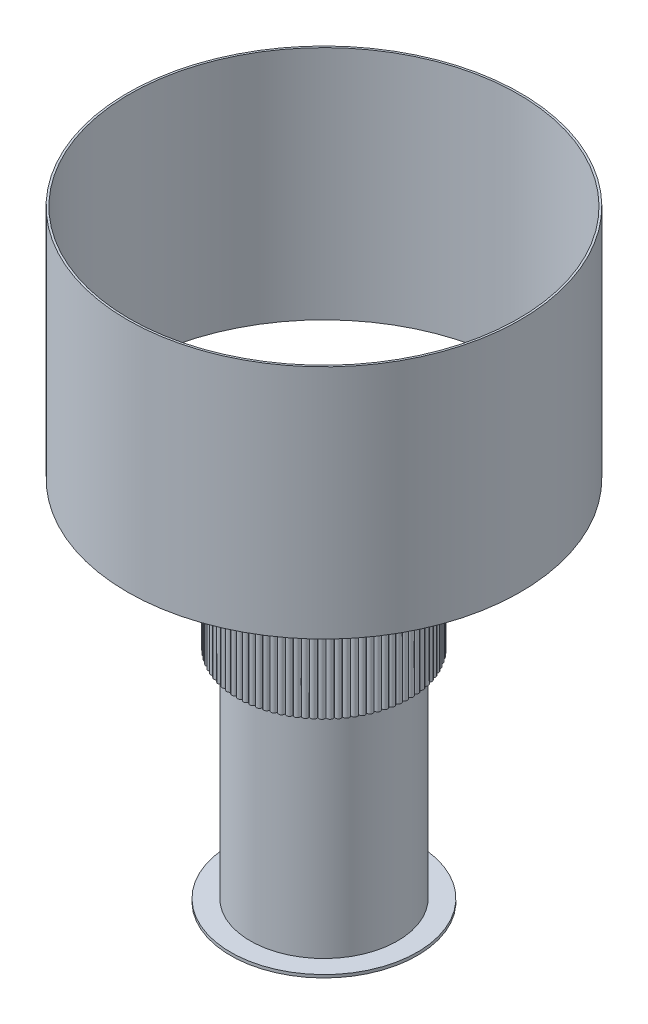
from build123d import *

# Parameters (mm, degrees)
SALIENTE_EXTRUIR1_DEPTH   = 100
CROQUIS2_R                = 77.5
CORTAR_EXTRUIR1_DEPTH     = 90
CROQUIS3_R                = 5
CORTAR_EXTRUIR2_DEPTH     = 75
CROQUIS4_R                = 75
CROQUIS4_R_2              = 71
SALIENTE_EXTRUIR2_DEPTH   = 310
CROQUIS5_R                = 6
SALIENTE_EXTRUIR3_DEPTH   = 50
CROQUIS6_R                = 200
CROQUIS6_R_2              = 198
SALIENTE_EXTRUIR4_DEPTH   = 240
CROQUIS7_R                = 95
SALIENTE_EXTRUIR5_DEPTH   = 3
CROQUIS8_R                = 5
SALIENTE_EXTRUIR6_DEPTH   = 5
SALIENTE_EXTRUIR6_2_DEPTH = 5
SALIENTE_EXTRUIR6_3_DEPTH = 5
REDONDEO1_R               = 1
REDONDEO2_R               = 1
REDONDEO3_R               = 1
CROQUIS9_R                = 15
SALIENTE_EXTRUIR7_DEPTH   = 2


with BuildPart() as part:
    # Croquis1 → Saliente-Extruir1 (new body)
    with BuildSketch(Plane(origin=(0, 0, 0), x_dir=(1, 0, 0), z_dir=(0, 1, 0))):
        with BuildLine():
            ThreePointArc((2.980262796, 85.34356028), (0, 88), (-2.980262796, 85.34356028))
            ThreePointArc((-2.980262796, 85.34356028), (-6.138569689, 87.785636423), (-8.926268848, 84.927775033))
            ThreePointArc((-8.926268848, 84.927775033), (-12.247232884, 87.143590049), (-14.828787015, 84.098230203))
            ThreePointArc((-14.828787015, 84.098230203), (-18.296228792, 86.076988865), (-20.659060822, 82.858967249))
            ThreePointArc((-20.659060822, 82.858967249), (-24.256087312, 84.591029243), (-26.388685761, 81.216023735))
            ThreePointArc((-26.388685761, 81.216023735), (-30.097772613, 82.692950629), (-31.989747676, 79.177403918))
            ThreePointArc((-31.989747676, 79.177403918), (-35.792824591, 80.392000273), (-37.434958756, 76.753039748))
            ThreePointArc((-37.434958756, 76.753039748), (-41.313497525, 77.699388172), (-42.69779048, 73.954742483))
            ThreePointArc((-42.69779048, 73.954742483), (-46.632895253, 74.628232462), (-47.752602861, 70.796145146))
            ThreePointArc((-47.752602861, 70.796145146), (-51.725102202, 71.193495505), (-52.57476936, 67.292636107))
            ThreePointArc((-52.57476936, 67.292636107), (-56.565309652, 67.411910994), (-57.140796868, 63.461284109))
            ThreePointArc((-57.140796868, 63.461284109), (-61.1299366, 63.30190243), (-61.428440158, 59.320755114))
            ThreePointArc((-61.428440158, 59.320755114), (-65.396744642, 58.88349336), (-65.416810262, 54.891221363))
            ThreePointArc((-65.416810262, 54.891221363), (-69.344946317, 54.178209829), (-69.086476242, 50.1942631))
            ThreePointArc((-69.086476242, 50.1942631), (-72.955306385, 49.208975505), (-72.419559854, 45.252763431))
            ThreePointArc((-72.419559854, 45.252763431), (-76.210235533, 44), (-75.39982265, 40.090796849))
            ThreePointArc((-75.39982265, 40.090796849), (-79.093876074, 38.576660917), (-78.012745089, 34.733511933))
            ThreePointArc((-78.012745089, 34.733511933), (-81.592179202, 32.965380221), (-80.245597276, 29.207008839))
            ThreePointArc((-80.245597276, 29.207008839), (-83.692973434, 27.193495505), (-82.08750098, 23.538212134))
            ThreePointArc((-82.08750098, 23.538212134), (-85.386023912, 21.289126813), (-83.52948263, 17.754739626))
            ThreePointArc((-83.52948263, 17.754739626), (-86.663082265, 15.281039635), (-84.564517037, 11.884767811))
            ThreePointArc((-84.564517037, 11.884767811), (-87.517926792, 9.198504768), (-85.187561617, 5.956894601))
            ThreePointArc((-85.187561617, 5.956894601), (-87.946392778, 3.07115571), (-85.395580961, 0))
            ThreePointArc((-85.395580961, 0), (-87.946392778, -3.07115571), (-85.187561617, -5.956894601))
            ThreePointArc((-85.187561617, -5.956894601), (-87.517926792, -9.198504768), (-84.564517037, -11.884767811))
            ThreePointArc((-84.564517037, -11.884767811), (-86.663082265, -15.281039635), (-83.52948263, -17.754739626))
            ThreePointArc((-83.52948263, -17.754739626), (-85.386023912, -21.289126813), (-82.08750098, -23.538212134))
            ThreePointArc((-82.08750098, -23.538212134), (-83.692973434, -27.193495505), (-80.245597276, -29.20700884))
            ThreePointArc((-80.245597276, -29.20700884), (-81.592179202, -32.965380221), (-78.012745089, -34.733511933))
            ThreePointArc((-78.012745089, -34.733511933), (-79.093876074, -38.576660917), (-75.39982265, -40.090796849))
            ThreePointArc((-75.39982265, -40.090796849), (-76.210235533, -44), (-72.419559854, -45.252763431))
            ThreePointArc((-72.419559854, -45.252763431), (-72.955306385, -49.208975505), (-69.086476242, -50.1942631))
            ThreePointArc((-69.086476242, -50.1942631), (-69.344946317, -54.178209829), (-65.416810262, -54.891221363))
            ThreePointArc((-65.416810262, -54.891221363), (-65.396744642, -58.88349336), (-61.428440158, -59.320755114))
            ThreePointArc((-61.428440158, -59.320755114), (-61.1299366, -63.30190243), (-57.140796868, -63.461284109))
            ThreePointArc((-57.140796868, -63.461284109), (-56.565309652, -67.411910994), (-52.57476936, -67.292636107))
            ThreePointArc((-52.57476936, -67.292636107), (-51.725102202, -71.193495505), (-47.752602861, -70.796145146))
            ThreePointArc((-47.752602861, -70.796145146), (-46.632895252, -74.628232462), (-42.69779048, -73.954742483))
            ThreePointArc((-42.69779048, -73.954742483), (-41.313497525, -77.699388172), (-37.434958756, -76.753039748))
            ThreePointArc((-37.434958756, -76.753039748), (-35.792824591, -80.392000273), (-31.989747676, -79.177403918))
            ThreePointArc((-31.989747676, -79.177403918), (-30.097772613, -82.692950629), (-26.388685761, -81.216023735))
            ThreePointArc((-26.388685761, -81.216023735), (-24.256087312, -84.591029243), (-20.659060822, -82.858967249))
            ThreePointArc((-20.659060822, -82.858967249), (-18.296228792, -86.076988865), (-14.828787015, -84.098230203))
            ThreePointArc((-14.828787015, -84.098230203), (-12.247232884, -87.143590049), (-8.926268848, -84.927775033))
            ThreePointArc((-8.926268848, -84.927775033), (-6.138569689, -87.785636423), (-2.980262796, -85.34356028))
            ThreePointArc((-2.980262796, -85.34356028), (0, -88), (2.980262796, -85.34356028))
            ThreePointArc((2.980262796, -85.34356028), (6.13856969, -87.785636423), (8.926268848, -84.927775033))
            ThreePointArc((8.926268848, -84.927775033), (12.247232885, -87.143590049), (14.828787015, -84.098230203))
            ThreePointArc((14.828787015, -84.098230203), (18.296228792, -86.076988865), (20.659060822, -82.858967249))
            ThreePointArc((20.659060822, -82.858967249), (24.256087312, -84.591029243), (26.388685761, -81.216023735))
            ThreePointArc((26.388685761, -81.216023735), (30.097772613, -82.692950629), (31.989747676, -79.177403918))
            ThreePointArc((31.989747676, -79.177403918), (35.792824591, -80.392000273), (37.434958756, -76.753039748))
            ThreePointArc((37.434958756, -76.753039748), (41.313497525, -77.699388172), (42.69779048, -73.954742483))
            ThreePointArc((42.69779048, -73.954742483), (46.632895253, -74.628232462), (47.752602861, -70.796145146))
            ThreePointArc((47.752602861, -70.796145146), (51.725102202, -71.193495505), (52.57476936, -67.292636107))
            ThreePointArc((52.57476936, -67.292636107), (56.565309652, -67.411910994), (57.140796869, -63.461284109))
            ThreePointArc((57.140796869, -63.461284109), (61.1299366, -63.30190243), (61.428440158, -59.320755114))
            ThreePointArc((61.428440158, -59.320755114), (65.396744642, -58.88349336), (65.416810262, -54.891221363))
            ThreePointArc((65.416810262, -54.891221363), (69.344946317, -54.178209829), (69.086476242, -50.1942631))
            ThreePointArc((69.086476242, -50.1942631), (72.955306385, -49.208975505), (72.419559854, -45.252763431))
            ThreePointArc((72.419559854, -45.252763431), (76.210235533, -44), (75.39982265, -40.090796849))
            ThreePointArc((75.39982265, -40.090796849), (79.093876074, -38.576660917), (78.012745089, -34.733511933))
            ThreePointArc((78.012745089, -34.733511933), (81.592179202, -32.965380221), (80.245597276, -29.207008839))
            ThreePointArc((80.245597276, -29.207008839), (83.692973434, -27.193495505), (82.08750098, -23.538212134))
            ThreePointArc((82.08750098, -23.538212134), (85.386023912, -21.289126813), (83.52948263, -17.754739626))
            ThreePointArc((83.52948263, -17.754739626), (86.663082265, -15.281039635), (84.564517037, -11.884767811))
            ThreePointArc((84.564517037, -11.884767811), (87.517926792, -9.198504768), (85.187561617, -5.956894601))
            ThreePointArc((85.187561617, -5.956894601), (87.946392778, -3.07115571), (85.395580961, 0))
            ThreePointArc((85.395580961, 0), (87.946392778, 3.07115571), (85.187561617, 5.956894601))
            ThreePointArc((85.187561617, 5.956894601), (87.517926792, 9.198504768), (84.564517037, 11.884767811))
            ThreePointArc((84.564517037, 11.884767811), (86.663082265, 15.281039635), (83.52948263, 17.754739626))
            ThreePointArc((83.52948263, 17.754739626), (85.386023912, 21.289126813), (82.08750098, 23.538212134))
            ThreePointArc((82.08750098, 23.538212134), (83.692973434, 27.193495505), (80.245597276, 29.20700884))
            ThreePointArc((80.245597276, 29.20700884), (81.592179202, 32.965380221), (78.012745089, 34.733511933))
            ThreePointArc((78.012745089, 34.733511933), (79.093876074, 38.576660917), (75.39982265, 40.090796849))
            ThreePointArc((75.39982265, 40.090796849), (76.210235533, 44), (72.419559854, 45.252763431))
            ThreePointArc((72.419559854, 45.252763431), (72.955306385, 49.208975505), (69.086476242, 50.1942631))
            ThreePointArc((69.086476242, 50.1942631), (69.344946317, 54.178209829), (65.416810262, 54.891221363))
            ThreePointArc((65.416810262, 54.891221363), (65.396744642, 58.88349336), (61.428440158, 59.320755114))
            ThreePointArc((61.428440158, 59.320755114), (61.1299366, 63.30190243), (57.140796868, 63.461284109))
            ThreePointArc((57.140796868, 63.461284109), (56.565309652, 67.411910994), (52.57476936, 67.292636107))
            ThreePointArc((52.57476936, 67.292636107), (51.725102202, 71.193495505), (47.752602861, 70.796145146))
            ThreePointArc((47.752602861, 70.796145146), (46.632895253, 74.628232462), (42.69779048, 73.954742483))
            ThreePointArc((42.69779048, 73.954742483), (41.313497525, 77.699388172), (37.434958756, 76.753039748))
            ThreePointArc((37.434958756, 76.753039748), (35.792824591, 80.392000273), (31.989747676, 79.177403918))
            ThreePointArc((31.989747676, 79.177403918), (30.097772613, 82.692950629), (26.388685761, 81.216023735))
            ThreePointArc((26.388685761, 81.216023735), (24.256087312, 84.591029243), (20.659060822, 82.858967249))
            ThreePointArc((20.659060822, 82.858967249), (18.296228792, 86.076988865), (14.828787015, 84.098230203))
            ThreePointArc((14.828787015, 84.098230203), (12.247232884, 87.143590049), (8.926268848, 84.927775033))
            ThreePointArc((8.926268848, 84.927775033), (6.138569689, 87.785636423), (2.980262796, 85.34356028))
        make_face()
    extrude(amount=SALIENTE_EXTRUIR1_DEPTH)

    # Croquis2 → Cortar-Extruir1 (cut)
    with BuildSketch(Plane.XZ):
        with Locations(Location((0, 0, 0), (0, 0, 270))):
            Circle(CROQUIS2_R)
    extrude(amount=-CORTAR_EXTRUIR1_DEPTH, mode=Mode.SUBTRACT)

    # Croquis3 → Cortar-Extruir2 (cut)
    with BuildSketch(Plane(origin=(0, 100, 0), x_dir=(1, 0, 0), z_dir=(0, 1, 0))):
        with Locations(Location((0, 0, 0), (0, 0, 270))):
            Circle(CROQUIS3_R)
    extrude(amount=-CORTAR_EXTRUIR2_DEPTH, mode=Mode.SUBTRACT)


with BuildPart() as body_2:
    # Croquis4 → Saliente-Extruir2 (new body)
    with BuildSketch(Plane.XZ.offset(-90)):
        with Locations(Location((0, 0, 0), (0, 0, 270))):
            Circle(CROQUIS4_R)
        with Locations(Location((0, 0, 0), (0, 0, 270))):
            Circle(CROQUIS4_R_2, mode=Mode.SUBTRACT)
    extrude(amount=SALIENTE_EXTRUIR2_DEPTH)


with BuildPart() as body_3:
    # Croquis5 → Saliente-Extruir3 (new body)
    with BuildSketch(Plane(origin=(0, 100, 0), x_dir=(1, 0, 0), z_dir=(0, 1, 0))):
        with Locations(Location((0, 0, 0), (0, 0, 270))):
            Circle(CROQUIS5_R)
    extrude(amount=SALIENTE_EXTRUIR3_DEPTH)


with BuildPart() as body_4:
    # Croquis6 → Saliente-Extruir4 (new body)
    with BuildSketch(Plane(origin=(0, 150, 0), x_dir=(1, 0, 0), z_dir=(0, 1, 0))):
        with Locations(Location((0, 0, 0), (0, 0, 270))):
            Circle(CROQUIS6_R)
        with Locations(Location((0, 0, 0), (0, 0, 270))):
            Circle(CROQUIS6_R_2, mode=Mode.SUBTRACT)
    extrude(amount=SALIENTE_EXTRUIR4_DEPTH)


with BuildPart() as body_5:
    # Croquis7 → Saliente-Extruir5 (new body)
    with BuildSketch(Plane.XZ.offset(220)):
        with Locations(Location((0, 0, 0), (0, 0, 270))):
            Circle(CROQUIS7_R)
    extrude(amount=SALIENTE_EXTRUIR5_DEPTH)


with BuildPart() as body_6:
    # Croquis8 → Saliente-Extruir6 (new body)
    with BuildSketch(Plane.XZ.offset(223)):
        with Locations(Location((0, 70, 0), (0, 0, 270))):
            Circle(CROQUIS8_R)
    extrude(amount=SALIENTE_EXTRUIR6_DEPTH)

    # Redondeo1
    redondeo1_edges = [body_6.edges().sort_by_distance(p)[0] for p in [
        (0, -228, 75),
    ]]
    fillet(redondeo1_edges, radius=REDONDEO1_R)


with BuildPart() as body_7:
    # Croquis8 → Saliente-Extruir6 2 (new body)
    with BuildSketch(Plane.XZ.offset(223)):
        with Locations(Location((-60.621778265, -35, 0), (0, 0, 270))):
            Circle(CROQUIS8_R)
    extrude(amount=SALIENTE_EXTRUIR6_2_DEPTH)

    # Redondeo2
    redondeo2_edges = [body_7.edges().sort_by_distance(p)[0] for p in [
        (-60.621778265, -228, -30),
    ]]
    fillet(redondeo2_edges, radius=REDONDEO2_R)


with BuildPart() as body_8:
    # Croquis8 → Saliente-Extruir6 3 (new body)
    with BuildSketch(Plane.XZ.offset(223)):
        with Locations(Location((60.621778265, -35, 0), (0, 0, 270))):
            Circle(CROQUIS8_R)
    extrude(amount=SALIENTE_EXTRUIR6_3_DEPTH)

    # Redondeo3
    redondeo3_edges = [body_8.edges().sort_by_distance(p)[0] for p in [
        (60.621778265, -228, -30),
    ]]
    fillet(redondeo3_edges, radius=REDONDEO3_R)


with BuildPart() as body_9:
    # Croquis9 → Saliente-Extruir7 (new body)
    with BuildSketch(Plane(origin=(0, 100, 0), x_dir=(1, 0, 0), z_dir=(0, 1, 0))):
        with Locations(Location((0, 0, 0), (0, 0, 270))):
            Circle(CROQUIS9_R)
    extrude(amount=SALIENTE_EXTRUIR7_DEPTH)


solid = Compound([part.part, body_2.part, body_3.part, body_4.part, body_5.part, body_6.part, body_7.part, body_8.part, body_9.part])
